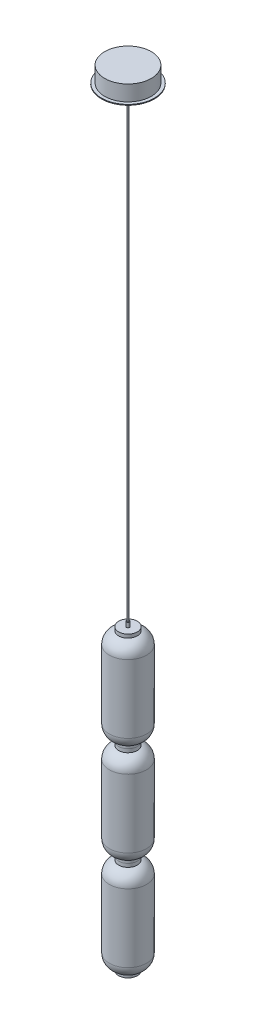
ISO-10303-21;
HEADER;
FILE_DESCRIPTION(('STEP AP214'),'2;1');
FILE_NAME('part.step','',(''),(''),'','','');
FILE_SCHEMA(('AUTOMOTIVE_DESIGN { 1 0 10303 214 1 1 1 1 }'));
ENDSEC;
DATA;
#1=APPLICATION_CONTEXT('core data for automotive mechanical design processes');
#2=APPLICATION_PROTOCOL_DEFINITION('international standard','automotive_design',2000,#1);
#3=PRODUCT_CONTEXT('',#1,'mechanical');
#4=PRODUCT('Part','Part','',(#3));
#5=PRODUCT_RELATED_PRODUCT_CATEGORY('part','',(#4));
#6=PRODUCT_DEFINITION_FORMATION('','',#4);
#7=PRODUCT_DEFINITION_CONTEXT('part definition',#1,'design');
#8=PRODUCT_DEFINITION('design','',#6,#7);
#9=PRODUCT_DEFINITION_SHAPE('','',#8);
#10=(LENGTH_UNIT() NAMED_UNIT(*) SI_UNIT(.MILLI.,.METRE.));
#11=(NAMED_UNIT(*) PLANE_ANGLE_UNIT() SI_UNIT($,.RADIAN.));
#12=(NAMED_UNIT(*) SI_UNIT($,.STERADIAN.) SOLID_ANGLE_UNIT());
#13=UNCERTAINTY_MEASURE_WITH_UNIT(LENGTH_MEASURE(1.E-05),#10,'distance_accuracy_value','');
#14=(GEOMETRIC_REPRESENTATION_CONTEXT(3) GLOBAL_UNCERTAINTY_ASSIGNED_CONTEXT((#13)) GLOBAL_UNIT_ASSIGNED_CONTEXT((#10,
#11,#12)) REPRESENTATION_CONTEXT('',''));
#15=CARTESIAN_POINT('',(0.,0.,0.));
#16=DIRECTION('',(0.,0.,1.));
#17=DIRECTION('',(1.,0.,0.));
#18=AXIS2_PLACEMENT_3D('',#15,#16,#17);
#19=CARTESIAN_POINT('',(0.,2465.,0.));
#20=DIRECTION('',(0.,-1.,0.));
#21=DIRECTION('',(0.,0.,-1.));
#22=AXIS2_PLACEMENT_3D('',#19,#20,#21);
#23=CYLINDRICAL_SURFACE('',#22,2.5);
#24=CARTESIAN_POINT('',(0.,2465.,0.));
#25=DIRECTION('',(0.,1.,0.));
#26=DIRECTION('',(0.,0.,1.));
#27=AXIS2_PLACEMENT_3D('',#24,#25,#26);
#28=CIRCLE('',#27,2.5);
#29=CARTESIAN_POINT('',(0.,2465.,2.5));
#30=VERTEX_POINT('',#29);
#31=EDGE_CURVE('E52',#30,#30,#28,.T.);
#32=ORIENTED_EDGE('',*,*,#31,.F.);
#33=EDGE_LOOP('',(#32));
#34=FACE_BOUND('',#33,.T.);
#35=CARTESIAN_POINT('',(0.,965.,0.));
#36=DIRECTION('',(0.,1.,0.));
#37=DIRECTION('',(0.,0.,1.));
#38=AXIS2_PLACEMENT_3D('',#35,#36,#37);
#39=CIRCLE('',#38,2.5);
#40=CARTESIAN_POINT('',(0.,965.,2.5));
#41=VERTEX_POINT('',#40);
#42=EDGE_CURVE('E48',#41,#41,#39,.T.);
#43=ORIENTED_EDGE('',*,*,#42,.T.);
#44=EDGE_LOOP('',(#43));
#45=FACE_BOUND('',#44,.T.);
#46=ADVANCED_FACE('F45',(#34,#45),#23,.T.);
#47=CARTESIAN_POINT('',(0.,965.,0.));
#48=DIRECTION('',(0.,1.,0.));
#49=DIRECTION('',(0.,0.,1.));
#50=AXIS2_PLACEMENT_3D('',#47,#48,#49);
#51=PLANE('',#50);
#52=ORIENTED_EDGE('',*,*,#42,.F.);
#53=EDGE_LOOP('',(#52));
#54=FACE_BOUND('',#53,.T.);
#55=ADVANCED_FACE('F86',(#54),#51,.F.);
#56=CARTESIAN_POINT('',(0.,2467.54,0.));
#57=DIRECTION('',(0.,-1.,0.));
#58=DIRECTION('',(0.,0.,-1.));
#59=AXIS2_PLACEMENT_3D('',#56,#57,#58);
#60=CYLINDRICAL_SURFACE('',#59,84.963);
#61=CARTESIAN_POINT('',(0.,2467.54,0.));
#62=DIRECTION('',(0.,1.,0.));
#63=DIRECTION('',(0.,0.,1.));
#64=AXIS2_PLACEMENT_3D('',#61,#62,#63);
#65=CIRCLE('',#64,84.963);
#66=CARTESIAN_POINT('',(0.,2467.54,84.963));
#67=VERTEX_POINT('',#66);
#68=EDGE_CURVE('E60',#67,#67,#65,.T.);
#69=ORIENTED_EDGE('',*,*,#68,.F.);
#70=EDGE_LOOP('',(#69));
#71=FACE_BOUND('',#70,.T.);
#72=CARTESIAN_POINT('',(0.,2465.,0.));
#73=DIRECTION('',(0.,1.,0.));
#74=DIRECTION('',(0.,0.,1.));
#75=AXIS2_PLACEMENT_3D('',#72,#73,#74);
#76=CIRCLE('',#75,84.963);
#77=CARTESIAN_POINT('',(0.,2465.,84.963));
#78=VERTEX_POINT('',#77);
#79=EDGE_CURVE('E63',#78,#78,#76,.T.);
#80=ORIENTED_EDGE('',*,*,#79,.T.);
#81=EDGE_LOOP('',(#80));
#82=FACE_BOUND('',#81,.T.);
#83=ADVANCED_FACE('F91',(#71,#82),#60,.T.);
#84=CARTESIAN_POINT('',(0.,2467.54,0.));
#85=DIRECTION('',(0.,1.,0.));
#86=DIRECTION('',(0.,0.,1.));
#87=AXIS2_PLACEMENT_3D('',#84,#85,#86);
#88=PLANE('',#87);
#89=CARTESIAN_POINT('',(0.,2467.54,0.));
#90=DIRECTION('',(0.,1.,0.));
#91=DIRECTION('',(0.,0.,1.));
#92=AXIS2_PLACEMENT_3D('',#89,#90,#91);
#93=CIRCLE('',#92,75.057);
#94=CARTESIAN_POINT('',(0.,2467.54,75.057));
#95=VERTEX_POINT('',#94);
#96=EDGE_CURVE('E11',#95,#95,#93,.T.);
#97=ORIENTED_EDGE('',*,*,#96,.F.);
#98=EDGE_LOOP('',(#97));
#99=FACE_BOUND('',#98,.T.);
#100=ORIENTED_EDGE('',*,*,#68,.T.);
#101=EDGE_LOOP('',(#100));
#102=FACE_BOUND('',#101,.T.);
#103=ADVANCED_FACE('F81',(#99,#102),#88,.T.);
#104=CARTESIAN_POINT('',(0.,2465.,0.));
#105=DIRECTION('',(0.,1.,0.));
#106=DIRECTION('',(0.,0.,1.));
#107=AXIS2_PLACEMENT_3D('',#104,#105,#106);
#108=PLANE('',#107);
#109=ORIENTED_EDGE('',*,*,#31,.T.);
#110=EDGE_LOOP('',(#109));
#111=FACE_BOUND('',#110,.T.);
#112=ORIENTED_EDGE('',*,*,#79,.F.);
#113=EDGE_LOOP('',(#112));
#114=FACE_BOUND('',#113,.T.);
#115=ADVANCED_FACE('F74',(#111,#114),#108,.F.);
#116=CARTESIAN_POINT('',(0.,2517.578,0.));
#117=DIRECTION('',(0.,-1.,0.));
#118=DIRECTION('',(0.,0.,-1.));
#119=AXIS2_PLACEMENT_3D('',#116,#117,#118);
#120=CYLINDRICAL_SURFACE('',#119,75.057);
#121=CARTESIAN_POINT('',(0.,2517.578,0.));
#122=DIRECTION('',(0.,1.,0.));
#123=DIRECTION('',(0.,0.,1.));
#124=AXIS2_PLACEMENT_3D('',#121,#122,#123);
#125=CIRCLE('',#124,75.057);
#126=CARTESIAN_POINT('',(0.,2517.578,75.057));
#127=VERTEX_POINT('',#126);
#128=EDGE_CURVE('E59',#127,#127,#125,.T.);
#129=ORIENTED_EDGE('',*,*,#128,.F.);
#130=EDGE_LOOP('',(#129));
#131=FACE_BOUND('',#130,.T.);
#132=ORIENTED_EDGE('',*,*,#96,.T.);
#133=EDGE_LOOP('',(#132));
#134=FACE_BOUND('',#133,.T.);
#135=ADVANCED_FACE('F72',(#131,#134),#120,.T.);
#136=CARTESIAN_POINT('',(0.,2517.578,0.));
#137=DIRECTION('',(0.,1.,0.));
#138=DIRECTION('',(0.,0.,1.));
#139=AXIS2_PLACEMENT_3D('',#136,#137,#138);
#140=PLANE('',#139);
#141=ORIENTED_EDGE('',*,*,#128,.T.);
#142=EDGE_LOOP('',(#141));
#143=FACE_BOUND('',#142,.T.);
#144=ADVANCED_FACE('F70',(#143),#140,.T.);
#145=CLOSED_SHELL('',(#46,#55,#83,#103,#115,#135,#144));
#146=MANIFOLD_SOLID_BREP('B2',#145);
#147=CARTESIAN_POINT('',(0.,630.,0.));
#148=DIRECTION('',(0.,1.,0.));
#149=DIRECTION('',(0.,0.,-1.));
#150=AXIS2_PLACEMENT_3D('',#147,#148,#149);
#151=CYLINDRICAL_SURFACE('',#150,30.);
#152=CARTESIAN_POINT('',(0.,630.,0.));
#153=DIRECTION('',(0.,1.,0.));
#154=DIRECTION('',(0.,0.,1.));
#155=AXIS2_PLACEMENT_3D('',#152,#153,#154);
#156=CIRCLE('',#155,30.);
#157=CARTESIAN_POINT('',(0.,630.,30.));
#158=VERTEX_POINT('',#157);
#159=EDGE_CURVE('E169',#158,#158,#156,.T.);
#160=ORIENTED_EDGE('',*,*,#159,.T.);
#161=EDGE_LOOP('',(#160));
#162=FACE_BOUND('',#161,.T.);
#163=CARTESIAN_POINT('',(0.,641.270166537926,0.));
#164=DIRECTION('',(0.,-1.,0.));
#165=DIRECTION('',(0.,0.,-1.));
#166=AXIS2_PLACEMENT_3D('',#163,#164,#165);
#167=CIRCLE('',#166,30.);
#168=CARTESIAN_POINT('',(0.,641.270166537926,-30.));
#169=VERTEX_POINT('',#168);
#170=EDGE_CURVE('E173',#169,#169,#167,.F.);
#171=ORIENTED_EDGE('',*,*,#170,.F.);
#172=EDGE_LOOP('',(#171));
#173=FACE_BOUND('',#172,.T.);
#174=ADVANCED_FACE('F163',(#162,#173),#151,.T.);
#175=CARTESIAN_POINT('',(0.,630.,0.));
#176=DIRECTION('',(0.,-1.,0.));
#177=DIRECTION('',(0.,0.,1.));
#178=AXIS2_PLACEMENT_3D('',#175,#176,#177);
#179=PLANE('',#178);
#180=ORIENTED_EDGE('',*,*,#159,.F.);
#181=EDGE_LOOP('',(#180));
#182=FACE_BOUND('',#181,.T.);
#183=ADVANCED_FACE('F184',(#182),#179,.T.);
#184=CARTESIAN_POINT('',(0.,680.,0.));
#185=DIRECTION('',(0.,1.,0.));
#186=DIRECTION('',(0.,0.,-1.));
#187=AXIS2_PLACEMENT_3D('',#184,#185,#186);
#188=DEGENERATE_TOROIDAL_SURFACE('',#187,20.,40.,.T.);
#189=ORIENTED_EDGE('',*,*,#170,.T.);
#190=EDGE_LOOP('',(#189));
#191=FACE_BOUND('',#190,.T.);
#192=CARTESIAN_POINT('',(0.,640.,0.));
#193=DIRECTION('',(0.,-1.,0.));
#194=DIRECTION('',(0.,0.,-1.));
#195=AXIS2_PLACEMENT_3D('',#192,#193,#194);
#196=CIRCLE('',#195,20.);
#197=CARTESIAN_POINT('',(0.,640.,-20.));
#198=VERTEX_POINT('',#197);
#199=EDGE_CURVE('E44',#198,#198,#196,.F.);
#200=ORIENTED_EDGE('',*,*,#199,.F.);
#201=EDGE_LOOP('',(#200));
#202=FACE_BOUND('',#201,.T.);
#203=ADVANCED_FACE('F180',(#191,#202),#188,.F.);
#204=CARTESIAN_POINT('',(0.,640.,0.));
#205=DIRECTION('',(0.,-1.,0.));
#206=DIRECTION('',(0.,0.,1.));
#207=AXIS2_PLACEMENT_3D('',#204,#205,#206);
#208=PLANE('',#207);
#209=ORIENTED_EDGE('',*,*,#199,.T.);
#210=EDGE_LOOP('',(#209));
#211=FACE_BOUND('',#210,.T.);
#212=ADVANCED_FACE('F193',(#211),#208,.F.);
#213=CLOSED_SHELL('',(#174,#183,#203,#212));
#214=MANIFOLD_SOLID_BREP('B6',#213);
#215=CARTESIAN_POINT('',(0.,310.,0.));
#216=DIRECTION('',(0.,1.,0.));
#217=DIRECTION('',(0.,0.,-1.));
#218=AXIS2_PLACEMENT_3D('',#215,#216,#217);
#219=CYLINDRICAL_SURFACE('',#218,30.);
#220=CARTESIAN_POINT('',(0.,310.,0.));
#221=DIRECTION('',(0.,1.,0.));
#222=DIRECTION('',(0.,0.,1.));
#223=AXIS2_PLACEMENT_3D('',#220,#221,#222);
#224=CIRCLE('',#223,30.);
#225=CARTESIAN_POINT('',(0.,310.,30.));
#226=VERTEX_POINT('',#225);
#227=EDGE_CURVE('E232',#226,#226,#224,.T.);
#228=ORIENTED_EDGE('',*,*,#227,.T.);
#229=EDGE_LOOP('',(#228));
#230=FACE_BOUND('',#229,.T.);
#231=CARTESIAN_POINT('',(0.,321.270166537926,0.));
#232=DIRECTION('',(0.,-1.,0.));
#233=DIRECTION('',(0.,0.,-1.));
#234=AXIS2_PLACEMENT_3D('',#231,#232,#233);
#235=CIRCLE('',#234,30.);
#236=CARTESIAN_POINT('',(0.,321.270166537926,-30.));
#237=VERTEX_POINT('',#236);
#238=EDGE_CURVE('E236',#237,#237,#235,.F.);
#239=ORIENTED_EDGE('',*,*,#238,.F.);
#240=EDGE_LOOP('',(#239));
#241=FACE_BOUND('',#240,.T.);
#242=ADVANCED_FACE('F226',(#230,#241),#219,.T.);
#243=CARTESIAN_POINT('',(0.,310.,0.));
#244=DIRECTION('',(0.,-1.,0.));
#245=DIRECTION('',(0.,0.,1.));
#246=AXIS2_PLACEMENT_3D('',#243,#244,#245);
#247=PLANE('',#246);
#248=ORIENTED_EDGE('',*,*,#227,.F.);
#249=EDGE_LOOP('',(#248));
#250=FACE_BOUND('',#249,.T.);
#251=ADVANCED_FACE('F247',(#250),#247,.T.);
#252=CARTESIAN_POINT('',(0.,360.,0.));
#253=DIRECTION('',(0.,1.,0.));
#254=DIRECTION('',(0.,0.,-1.));
#255=AXIS2_PLACEMENT_3D('',#252,#253,#254);
#256=DEGENERATE_TOROIDAL_SURFACE('',#255,20.,40.,.T.);
#257=ORIENTED_EDGE('',*,*,#238,.T.);
#258=EDGE_LOOP('',(#257));
#259=FACE_BOUND('',#258,.T.);
#260=CARTESIAN_POINT('',(0.,320.,0.));
#261=DIRECTION('',(0.,-1.,0.));
#262=DIRECTION('',(0.,0.,-1.));
#263=AXIS2_PLACEMENT_3D('',#260,#261,#262);
#264=CIRCLE('',#263,20.);
#265=CARTESIAN_POINT('',(0.,320.,-20.));
#266=VERTEX_POINT('',#265);
#267=EDGE_CURVE('E162',#266,#266,#264,.F.);
#268=ORIENTED_EDGE('',*,*,#267,.F.);
#269=EDGE_LOOP('',(#268));
#270=FACE_BOUND('',#269,.T.);
#271=ADVANCED_FACE('F243',(#259,#270),#256,.F.);
#272=CARTESIAN_POINT('',(0.,320.,0.));
#273=DIRECTION('',(0.,-1.,0.));
#274=DIRECTION('',(0.,0.,1.));
#275=AXIS2_PLACEMENT_3D('',#272,#273,#274);
#276=PLANE('',#275);
#277=ORIENTED_EDGE('',*,*,#267,.T.);
#278=EDGE_LOOP('',(#277));
#279=FACE_BOUND('',#278,.T.);
#280=ADVANCED_FACE('F256',(#279),#276,.F.);
#281=CLOSED_SHELL('',(#242,#251,#271,#280));
#282=MANIFOLD_SOLID_BREP('B39',#281);
#283=CARTESIAN_POINT('',(-20.,940.,0.));
#284=DIRECTION('',(0.,-1.,0.));
#285=DIRECTION('',(0.,0.,-1.));
#286=AXIS2_PLACEMENT_3D('',#283,#284,#285);
#287=PLANE('',#286);
#288=CARTESIAN_POINT('',(0.,940.,0.));
#289=DIRECTION('',(0.,-1.,0.));
#290=DIRECTION('',(0.,0.,-1.));
#291=AXIS2_PLACEMENT_3D('',#288,#289,#290);
#292=CIRCLE('',#291,20.);
#293=CARTESIAN_POINT('',(0.,940.,-20.));
#294=VERTEX_POINT('',#293);
#295=EDGE_CURVE('E225',#294,#294,#292,.T.);
#296=ORIENTED_EDGE('',*,*,#295,.F.);
#297=EDGE_LOOP('',(#296));
#298=FACE_BOUND('',#297,.T.);
#299=ADVANCED_FACE('F289',(#298),#287,.F.);
#300=CARTESIAN_POINT('',(0.,900.,0.));
#301=DIRECTION('',(0.,-1.,0.));
#302=DIRECTION('',(0.,0.,-1.));
#303=AXIS2_PLACEMENT_3D('',#300,#301,#302);
#304=DEGENERATE_TOROIDAL_SURFACE('',#303,20.,40.,.T.);
#305=CARTESIAN_POINT('',(0.,900.,0.));
#306=DIRECTION('',(0.,-1.,0.));
#307=DIRECTION('',(0.,0.,-1.));
#308=AXIS2_PLACEMENT_3D('',#305,#306,#307);
#309=CIRCLE('',#308,60.);
#310=CARTESIAN_POINT('',(0.,900.,-60.));
#311=VERTEX_POINT('',#310);
#312=EDGE_CURVE('E295',#311,#311,#309,.T.);
#313=ORIENTED_EDGE('',*,*,#312,.F.);
#314=EDGE_LOOP('',(#313));
#315=FACE_BOUND('',#314,.T.);
#316=ORIENTED_EDGE('',*,*,#295,.T.);
#317=EDGE_LOOP('',(#316));
#318=FACE_BOUND('',#317,.T.);
#319=ADVANCED_FACE('F332',(#315,#318),#304,.T.);
#320=CARTESIAN_POINT('',(0.,640.,0.));
#321=DIRECTION('',(0.,-1.,0.));
#322=DIRECTION('',(0.,0.,-1.));
#323=AXIS2_PLACEMENT_3D('',#320,#321,#322);
#324=CYLINDRICAL_SURFACE('',#323,60.);
#325=CARTESIAN_POINT('',(0.,680.,0.));
#326=DIRECTION('',(0.,-1.,0.));
#327=DIRECTION('',(0.,0.,-1.));
#328=AXIS2_PLACEMENT_3D('',#325,#326,#327);
#329=CIRCLE('',#328,60.);
#330=CARTESIAN_POINT('',(0.,680.,-60.));
#331=VERTEX_POINT('',#330);
#332=EDGE_CURVE('E299',#331,#331,#329,.T.);
#333=ORIENTED_EDGE('',*,*,#332,.F.);
#334=EDGE_LOOP('',(#333));
#335=FACE_BOUND('',#334,.T.);
#336=ORIENTED_EDGE('',*,*,#312,.T.);
#337=EDGE_LOOP('',(#336));
#338=FACE_BOUND('',#337,.T.);
#339=ADVANCED_FACE('F327',(#335,#338),#324,.T.);
#340=CARTESIAN_POINT('',(0.,680.,0.));
#341=DIRECTION('',(0.,-1.,0.));
#342=DIRECTION('',(0.,0.,-1.));
#343=AXIS2_PLACEMENT_3D('',#340,#341,#342);
#344=DEGENERATE_TOROIDAL_SURFACE('',#343,20.,40.,.T.);
#345=CARTESIAN_POINT('',(0.,640.,0.));
#346=DIRECTION('',(0.,-1.,0.));
#347=DIRECTION('',(0.,0.,-1.));
#348=AXIS2_PLACEMENT_3D('',#345,#346,#347);
#349=CIRCLE('',#348,20.);
#350=CARTESIAN_POINT('',(0.,640.,-20.));
#351=VERTEX_POINT('',#350);
#352=EDGE_CURVE('E313',#351,#351,#349,.T.);
#353=ORIENTED_EDGE('',*,*,#352,.F.);
#354=EDGE_LOOP('',(#353));
#355=FACE_BOUND('',#354,.T.);
#356=ORIENTED_EDGE('',*,*,#332,.T.);
#357=EDGE_LOOP('',(#356));
#358=FACE_BOUND('',#357,.T.);
#359=ADVANCED_FACE('F324',(#355,#358),#344,.T.);
#360=CARTESIAN_POINT('',(0.,640.,0.));
#361=DIRECTION('',(0.,1.,0.));
#362=DIRECTION('',(0.,0.,1.));
#363=AXIS2_PLACEMENT_3D('',#360,#361,#362);
#364=CYLINDRICAL_SURFACE('',#363,20.);
#365=ORIENTED_EDGE('',*,*,#352,.T.);
#366=EDGE_LOOP('',(#365));
#367=FACE_BOUND('',#366,.T.);
#368=CARTESIAN_POINT('',(0.,648.,0.));
#369=DIRECTION('',(0.,1.,0.));
#370=DIRECTION('',(0.,0.,1.));
#371=AXIS2_PLACEMENT_3D('',#368,#369,#370);
#372=CIRCLE('',#371,20.);
#373=CARTESIAN_POINT('',(0.,648.,20.));
#374=VERTEX_POINT('',#373);
#375=EDGE_CURVE('E303',#374,#374,#372,.F.);
#376=ORIENTED_EDGE('',*,*,#375,.F.);
#377=EDGE_LOOP('',(#376));
#378=FACE_BOUND('',#377,.T.);
#379=ADVANCED_FACE('F321',(#367,#378),#364,.F.);
#380=CARTESIAN_POINT('',(-20.,932.,0.));
#381=DIRECTION('',(0.,-1.,0.));
#382=DIRECTION('',(0.,0.,-1.));
#383=AXIS2_PLACEMENT_3D('',#380,#381,#382);
#384=PLANE('',#383);
#385=CARTESIAN_POINT('',(0.,932.,0.));
#386=DIRECTION('',(0.,-1.,0.));
#387=DIRECTION('',(0.,0.,-1.));
#388=AXIS2_PLACEMENT_3D('',#385,#386,#387);
#389=CIRCLE('',#388,20.);
#390=CARTESIAN_POINT('',(0.,932.,-20.));
#391=VERTEX_POINT('',#390);
#392=EDGE_CURVE('E308',#391,#391,#389,.T.);
#393=ORIENTED_EDGE('',*,*,#392,.T.);
#394=EDGE_LOOP('',(#393));
#395=FACE_BOUND('',#394,.T.);
#396=ADVANCED_FACE('F365',(#395),#384,.T.);
#397=CARTESIAN_POINT('',(0.,900.,0.));
#398=DIRECTION('',(0.,-1.,0.));
#399=DIRECTION('',(0.,0.,-1.));
#400=AXIS2_PLACEMENT_3D('',#397,#398,#399);
#401=DEGENERATE_TOROIDAL_SURFACE('',#400,20.,32.,.T.);
#402=CARTESIAN_POINT('',(0.,900.,0.));
#403=DIRECTION('',(0.,-1.,0.));
#404=DIRECTION('',(0.,0.,-1.));
#405=AXIS2_PLACEMENT_3D('',#402,#403,#404);
#406=CIRCLE('',#405,52.);
#407=CARTESIAN_POINT('',(0.,900.,-52.));
#408=VERTEX_POINT('',#407);
#409=EDGE_CURVE('E312',#408,#408,#406,.T.);
#410=ORIENTED_EDGE('',*,*,#409,.T.);
#411=EDGE_LOOP('',(#410));
#412=FACE_BOUND('',#411,.T.);
#413=ORIENTED_EDGE('',*,*,#392,.F.);
#414=EDGE_LOOP('',(#413));
#415=FACE_BOUND('',#414,.T.);
#416=ADVANCED_FACE('F374',(#412,#415),#401,.F.);
#417=CARTESIAN_POINT('',(0.,640.,0.));
#418=DIRECTION('',(0.,-1.,0.));
#419=DIRECTION('',(0.,0.,-1.));
#420=AXIS2_PLACEMENT_3D('',#417,#418,#419);
#421=CYLINDRICAL_SURFACE('',#420,52.);
#422=CARTESIAN_POINT('',(0.,680.,0.));
#423=DIRECTION('',(0.,-1.,0.));
#424=DIRECTION('',(0.,0.,-1.));
#425=AXIS2_PLACEMENT_3D('',#422,#423,#424);
#426=CIRCLE('',#425,52.);
#427=CARTESIAN_POINT('',(0.,680.,-52.));
#428=VERTEX_POINT('',#427);
#429=EDGE_CURVE('E309',#428,#428,#426,.T.);
#430=ORIENTED_EDGE('',*,*,#429,.T.);
#431=EDGE_LOOP('',(#430));
#432=FACE_BOUND('',#431,.T.);
#433=ORIENTED_EDGE('',*,*,#409,.F.);
#434=EDGE_LOOP('',(#433));
#435=FACE_BOUND('',#434,.T.);
#436=ADVANCED_FACE('F384',(#432,#435),#421,.F.);
#437=CARTESIAN_POINT('',(0.,680.,0.));
#438=DIRECTION('',(0.,-1.,0.));
#439=DIRECTION('',(0.,0.,-1.));
#440=AXIS2_PLACEMENT_3D('',#437,#438,#439);
#441=DEGENERATE_TOROIDAL_SURFACE('',#440,20.,32.,.T.);
#442=ORIENTED_EDGE('',*,*,#375,.T.);
#443=EDGE_LOOP('',(#442));
#444=FACE_BOUND('',#443,.T.);
#445=ORIENTED_EDGE('',*,*,#429,.F.);
#446=EDGE_LOOP('',(#445));
#447=FACE_BOUND('',#446,.T.);
#448=ADVANCED_FACE('F394',(#444,#447),#441,.F.);
#449=CLOSED_SHELL('',(#299,#319,#339,#359,#379,#396,#416,#436,#448));
#450=MANIFOLD_SOLID_BREP('B157',#449);
#451=CARTESIAN_POINT('',(-20.,620.,0.));
#452=DIRECTION('',(0.,-1.,0.));
#453=DIRECTION('',(0.,0.,-1.));
#454=AXIS2_PLACEMENT_3D('',#451,#452,#453);
#455=PLANE('',#454);
#456=CARTESIAN_POINT('',(0.,620.,0.));
#457=DIRECTION('',(0.,-1.,0.));
#458=DIRECTION('',(0.,0.,-1.));
#459=AXIS2_PLACEMENT_3D('',#456,#457,#458);
#460=CIRCLE('',#459,20.);
#461=CARTESIAN_POINT('',(0.,620.,-20.));
#462=VERTEX_POINT('',#461);
#463=EDGE_CURVE('E288',#462,#462,#460,.T.);
#464=ORIENTED_EDGE('',*,*,#463,.F.);
#465=EDGE_LOOP('',(#464));
#466=FACE_BOUND('',#465,.T.);
#467=ADVANCED_FACE('F427',(#466),#455,.F.);
#468=CARTESIAN_POINT('',(0.,580.,0.));
#469=DIRECTION('',(0.,-1.,0.));
#470=DIRECTION('',(0.,0.,-1.));
#471=AXIS2_PLACEMENT_3D('',#468,#469,#470);
#472=DEGENERATE_TOROIDAL_SURFACE('',#471,20.,40.,.T.);
#473=CARTESIAN_POINT('',(0.,580.,0.));
#474=DIRECTION('',(0.,-1.,0.));
#475=DIRECTION('',(0.,0.,-1.));
#476=AXIS2_PLACEMENT_3D('',#473,#474,#475);
#477=CIRCLE('',#476,60.);
#478=CARTESIAN_POINT('',(0.,580.,-60.));
#479=VERTEX_POINT('',#478);
#480=EDGE_CURVE('E433',#479,#479,#477,.T.);
#481=ORIENTED_EDGE('',*,*,#480,.F.);
#482=EDGE_LOOP('',(#481));
#483=FACE_BOUND('',#482,.T.);
#484=ORIENTED_EDGE('',*,*,#463,.T.);
#485=EDGE_LOOP('',(#484));
#486=FACE_BOUND('',#485,.T.);
#487=ADVANCED_FACE('F470',(#483,#486),#472,.T.);
#488=CARTESIAN_POINT('',(0.,320.,0.));
#489=DIRECTION('',(0.,-1.,0.));
#490=DIRECTION('',(0.,0.,-1.));
#491=AXIS2_PLACEMENT_3D('',#488,#489,#490);
#492=CYLINDRICAL_SURFACE('',#491,60.);
#493=CARTESIAN_POINT('',(0.,360.,0.));
#494=DIRECTION('',(0.,-1.,0.));
#495=DIRECTION('',(0.,0.,-1.));
#496=AXIS2_PLACEMENT_3D('',#493,#494,#495);
#497=CIRCLE('',#496,60.);
#498=CARTESIAN_POINT('',(0.,360.,-60.));
#499=VERTEX_POINT('',#498);
#500=EDGE_CURVE('E437',#499,#499,#497,.T.);
#501=ORIENTED_EDGE('',*,*,#500,.F.);
#502=EDGE_LOOP('',(#501));
#503=FACE_BOUND('',#502,.T.);
#504=ORIENTED_EDGE('',*,*,#480,.T.);
#505=EDGE_LOOP('',(#504));
#506=FACE_BOUND('',#505,.T.);
#507=ADVANCED_FACE('F465',(#503,#506),#492,.T.);
#508=CARTESIAN_POINT('',(0.,360.,0.));
#509=DIRECTION('',(0.,-1.,0.));
#510=DIRECTION('',(0.,0.,-1.));
#511=AXIS2_PLACEMENT_3D('',#508,#509,#510);
#512=DEGENERATE_TOROIDAL_SURFACE('',#511,20.,40.,.T.);
#513=CARTESIAN_POINT('',(0.,320.,0.));
#514=DIRECTION('',(0.,-1.,0.));
#515=DIRECTION('',(0.,0.,-1.));
#516=AXIS2_PLACEMENT_3D('',#513,#514,#515);
#517=CIRCLE('',#516,20.);
#518=CARTESIAN_POINT('',(0.,320.,-20.));
#519=VERTEX_POINT('',#518);
#520=EDGE_CURVE('E451',#519,#519,#517,.T.);
#521=ORIENTED_EDGE('',*,*,#520,.F.);
#522=EDGE_LOOP('',(#521));
#523=FACE_BOUND('',#522,.T.);
#524=ORIENTED_EDGE('',*,*,#500,.T.);
#525=EDGE_LOOP('',(#524));
#526=FACE_BOUND('',#525,.T.);
#527=ADVANCED_FACE('F462',(#523,#526),#512,.T.);
#528=CARTESIAN_POINT('',(0.,320.,0.));
#529=DIRECTION('',(0.,1.,0.));
#530=DIRECTION('',(0.,0.,1.));
#531=AXIS2_PLACEMENT_3D('',#528,#529,#530);
#532=CYLINDRICAL_SURFACE('',#531,20.);
#533=ORIENTED_EDGE('',*,*,#520,.T.);
#534=EDGE_LOOP('',(#533));
#535=FACE_BOUND('',#534,.T.);
#536=CARTESIAN_POINT('',(0.,328.,0.));
#537=DIRECTION('',(0.,1.,0.));
#538=DIRECTION('',(0.,0.,1.));
#539=AXIS2_PLACEMENT_3D('',#536,#537,#538);
#540=CIRCLE('',#539,20.);
#541=CARTESIAN_POINT('',(0.,328.,20.));
#542=VERTEX_POINT('',#541);
#543=EDGE_CURVE('E441',#542,#542,#540,.F.);
#544=ORIENTED_EDGE('',*,*,#543,.F.);
#545=EDGE_LOOP('',(#544));
#546=FACE_BOUND('',#545,.T.);
#547=ADVANCED_FACE('F459',(#535,#546),#532,.F.);
#548=CARTESIAN_POINT('',(-20.,612.,0.));
#549=DIRECTION('',(0.,-1.,0.));
#550=DIRECTION('',(0.,0.,-1.));
#551=AXIS2_PLACEMENT_3D('',#548,#549,#550);
#552=PLANE('',#551);
#553=CARTESIAN_POINT('',(0.,612.,0.));
#554=DIRECTION('',(0.,-1.,0.));
#555=DIRECTION('',(0.,0.,-1.));
#556=AXIS2_PLACEMENT_3D('',#553,#554,#555);
#557=CIRCLE('',#556,20.);
#558=CARTESIAN_POINT('',(0.,612.,-20.));
#559=VERTEX_POINT('',#558);
#560=EDGE_CURVE('E446',#559,#559,#557,.T.);
#561=ORIENTED_EDGE('',*,*,#560,.T.);
#562=EDGE_LOOP('',(#561));
#563=FACE_BOUND('',#562,.T.);
#564=ADVANCED_FACE('F503',(#563),#552,.T.);
#565=CARTESIAN_POINT('',(0.,580.,0.));
#566=DIRECTION('',(0.,-1.,0.));
#567=DIRECTION('',(0.,0.,-1.));
#568=AXIS2_PLACEMENT_3D('',#565,#566,#567);
#569=DEGENERATE_TOROIDAL_SURFACE('',#568,20.,32.,.T.);
#570=CARTESIAN_POINT('',(0.,580.,0.));
#571=DIRECTION('',(0.,-1.,0.));
#572=DIRECTION('',(0.,0.,-1.));
#573=AXIS2_PLACEMENT_3D('',#570,#571,#572);
#574=CIRCLE('',#573,52.);
#575=CARTESIAN_POINT('',(0.,580.,-52.));
#576=VERTEX_POINT('',#575);
#577=EDGE_CURVE('E450',#576,#576,#574,.T.);
#578=ORIENTED_EDGE('',*,*,#577,.T.);
#579=EDGE_LOOP('',(#578));
#580=FACE_BOUND('',#579,.T.);
#581=ORIENTED_EDGE('',*,*,#560,.F.);
#582=EDGE_LOOP('',(#581));
#583=FACE_BOUND('',#582,.T.);
#584=ADVANCED_FACE('F512',(#580,#583),#569,.F.);
#585=CARTESIAN_POINT('',(0.,320.,0.));
#586=DIRECTION('',(0.,-1.,0.));
#587=DIRECTION('',(0.,0.,-1.));
#588=AXIS2_PLACEMENT_3D('',#585,#586,#587);
#589=CYLINDRICAL_SURFACE('',#588,52.);
#590=CARTESIAN_POINT('',(0.,360.,0.));
#591=DIRECTION('',(0.,-1.,0.));
#592=DIRECTION('',(0.,0.,-1.));
#593=AXIS2_PLACEMENT_3D('',#590,#591,#592);
#594=CIRCLE('',#593,52.);
#595=CARTESIAN_POINT('',(0.,360.,-52.));
#596=VERTEX_POINT('',#595);
#597=EDGE_CURVE('E447',#596,#596,#594,.T.);
#598=ORIENTED_EDGE('',*,*,#597,.T.);
#599=EDGE_LOOP('',(#598));
#600=FACE_BOUND('',#599,.T.);
#601=ORIENTED_EDGE('',*,*,#577,.F.);
#602=EDGE_LOOP('',(#601));
#603=FACE_BOUND('',#602,.T.);
#604=ADVANCED_FACE('F522',(#600,#603),#589,.F.);
#605=CARTESIAN_POINT('',(0.,360.,0.));
#606=DIRECTION('',(0.,-1.,0.));
#607=DIRECTION('',(0.,0.,-1.));
#608=AXIS2_PLACEMENT_3D('',#605,#606,#607);
#609=DEGENERATE_TOROIDAL_SURFACE('',#608,20.,32.,.T.);
#610=ORIENTED_EDGE('',*,*,#543,.T.);
#611=EDGE_LOOP('',(#610));
#612=FACE_BOUND('',#611,.T.);
#613=ORIENTED_EDGE('',*,*,#597,.F.);
#614=EDGE_LOOP('',(#613));
#615=FACE_BOUND('',#614,.T.);
#616=ADVANCED_FACE('F532',(#612,#615),#609,.F.);
#617=CLOSED_SHELL('',(#467,#487,#507,#527,#547,#564,#584,#604,#616));
#618=MANIFOLD_SOLID_BREP('B220',#617);
#619=CARTESIAN_POINT('',(0.,950.,0.));
#620=DIRECTION('',(0.,-1.,0.));
#621=DIRECTION('',(0.,0.,-1.));
#622=AXIS2_PLACEMENT_3D('',#619,#620,#621);
#623=CYLINDRICAL_SURFACE('',#622,30.);
#624=CARTESIAN_POINT('',(0.,950.,0.));
#625=DIRECTION('',(0.,1.,0.));
#626=DIRECTION('',(0.,0.,1.));
#627=AXIS2_PLACEMENT_3D('',#624,#625,#626);
#628=CIRCLE('',#627,30.);
#629=CARTESIAN_POINT('',(0.,950.,30.));
#630=VERTEX_POINT('',#629);
#631=EDGE_CURVE('E576',#630,#630,#628,.T.);
#632=ORIENTED_EDGE('',*,*,#631,.F.);
#633=EDGE_LOOP('',(#632));
#634=FACE_BOUND('',#633,.T.);
#635=CARTESIAN_POINT('',(0.,938.729833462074,0.));
#636=DIRECTION('',(0.,-1.,0.));
#637=DIRECTION('',(0.,0.,-1.));
#638=AXIS2_PLACEMENT_3D('',#635,#636,#637);
#639=CIRCLE('',#638,30.);
#640=CARTESIAN_POINT('',(0.,938.729833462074,-30.));
#641=VERTEX_POINT('',#640);
#642=EDGE_CURVE('E580',#641,#641,#639,.F.);
#643=ORIENTED_EDGE('',*,*,#642,.T.);
#644=EDGE_LOOP('',(#643));
#645=FACE_BOUND('',#644,.T.);
#646=ADVANCED_FACE('F565',(#634,#645),#623,.T.);
#647=CARTESIAN_POINT('',(0.,950.,0.));
#648=DIRECTION('',(0.,1.,0.));
#649=DIRECTION('',(0.,0.,1.));
#650=AXIS2_PLACEMENT_3D('',#647,#648,#649);
#651=PLANE('',#650);
#652=CARTESIAN_POINT('',(0.,950.,0.));
#653=DIRECTION('',(0.,1.,0.));
#654=DIRECTION('',(0.,0.,1.));
#655=AXIS2_PLACEMENT_3D('',#652,#653,#654);
#656=CIRCLE('',#655,5.);
#657=CARTESIAN_POINT('',(0.,950.,5.));
#658=VERTEX_POINT('',#657);
#659=EDGE_CURVE('E426',#658,#658,#656,.T.);
#660=ORIENTED_EDGE('',*,*,#659,.F.);
#661=EDGE_LOOP('',(#660));
#662=FACE_BOUND('',#661,.T.);
#663=ORIENTED_EDGE('',*,*,#631,.T.);
#664=EDGE_LOOP('',(#663));
#665=FACE_BOUND('',#664,.T.);
#666=ADVANCED_FACE('F585',(#662,#665),#651,.T.);
#667=CARTESIAN_POINT('',(0.,900.,0.));
#668=DIRECTION('',(0.,-1.,0.));
#669=DIRECTION('',(0.,0.,-1.));
#670=AXIS2_PLACEMENT_3D('',#667,#668,#669);
#671=DEGENERATE_TOROIDAL_SURFACE('',#670,20.,40.,.T.);
#672=ORIENTED_EDGE('',*,*,#642,.F.);
#673=EDGE_LOOP('',(#672));
#674=FACE_BOUND('',#673,.T.);
#675=CARTESIAN_POINT('',(0.,940.,0.));
#676=DIRECTION('',(0.,-1.,0.));
#677=DIRECTION('',(0.,0.,-1.));
#678=AXIS2_PLACEMENT_3D('',#675,#676,#677);
#679=CIRCLE('',#678,20.);
#680=CARTESIAN_POINT('',(0.,940.,-20.));
#681=VERTEX_POINT('',#680);
#682=EDGE_CURVE('E568',#681,#681,#679,.F.);
#683=ORIENTED_EDGE('',*,*,#682,.T.);
#684=EDGE_LOOP('',(#683));
#685=FACE_BOUND('',#684,.T.);
#686=ADVANCED_FACE('F591',(#674,#685),#671,.F.);
#687=CARTESIAN_POINT('',(0.,940.,0.));
#688=DIRECTION('',(0.,1.,0.));
#689=DIRECTION('',(0.,0.,1.));
#690=AXIS2_PLACEMENT_3D('',#687,#688,#689);
#691=PLANE('',#690);
#692=ORIENTED_EDGE('',*,*,#682,.F.);
#693=EDGE_LOOP('',(#692));
#694=FACE_BOUND('',#693,.T.);
#695=ADVANCED_FACE('F594',(#694),#691,.F.);
#696=CARTESIAN_POINT('',(0.,965.,0.));
#697=DIRECTION('',(0.,-1.,0.));
#698=DIRECTION('',(0.,0.,-1.));
#699=AXIS2_PLACEMENT_3D('',#696,#697,#698);
#700=CYLINDRICAL_SURFACE('',#699,5.);
#701=CARTESIAN_POINT('',(0.,965.,0.));
#702=DIRECTION('',(0.,1.,0.));
#703=DIRECTION('',(0.,0.,1.));
#704=AXIS2_PLACEMENT_3D('',#701,#702,#703);
#705=CIRCLE('',#704,5.);
#706=CARTESIAN_POINT('',(0.,965.,5.));
#707=VERTEX_POINT('',#706);
#708=EDGE_CURVE('E579',#707,#707,#705,.T.);
#709=ORIENTED_EDGE('',*,*,#708,.F.);
#710=EDGE_LOOP('',(#709));
#711=FACE_BOUND('',#710,.T.);
#712=ORIENTED_EDGE('',*,*,#659,.T.);
#713=EDGE_LOOP('',(#712));
#714=FACE_BOUND('',#713,.T.);
#715=ADVANCED_FACE('F599',(#711,#714),#700,.T.);
#716=CARTESIAN_POINT('',(0.,965.,0.));
#717=DIRECTION('',(0.,1.,0.));
#718=DIRECTION('',(0.,0.,1.));
#719=AXIS2_PLACEMENT_3D('',#716,#717,#718);
#720=PLANE('',#719);
#721=ORIENTED_EDGE('',*,*,#708,.T.);
#722=EDGE_LOOP('',(#721));
#723=FACE_BOUND('',#722,.T.);
#724=ADVANCED_FACE('F603',(#723),#720,.T.);
#725=CLOSED_SHELL('',(#646,#666,#686,#695,#715,#724));
#726=MANIFOLD_SOLID_BREP('B283',#725);
#727=CARTESIAN_POINT('',(0.,630.,0.));
#728=DIRECTION('',(0.,-1.,0.));
#729=DIRECTION('',(0.,0.,-1.));
#730=AXIS2_PLACEMENT_3D('',#727,#728,#729);
#731=CYLINDRICAL_SURFACE('',#730,30.);
#732=CARTESIAN_POINT('',(0.,630.,0.));
#733=DIRECTION('',(0.,1.,0.));
#734=DIRECTION('',(0.,0.,1.));
#735=AXIS2_PLACEMENT_3D('',#732,#733,#734);
#736=CIRCLE('',#735,30.);
#737=CARTESIAN_POINT('',(0.,630.,30.));
#738=VERTEX_POINT('',#737);
#739=EDGE_CURVE('E664',#738,#738,#736,.T.);
#740=ORIENTED_EDGE('',*,*,#739,.F.);
#741=EDGE_LOOP('',(#740));
#742=FACE_BOUND('',#741,.T.);
#743=CARTESIAN_POINT('',(0.,618.729833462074,0.));
#744=DIRECTION('',(0.,-1.,0.));
#745=DIRECTION('',(0.,0.,-1.));
#746=AXIS2_PLACEMENT_3D('',#743,#744,#745);
#747=CIRCLE('',#746,30.);
#748=CARTESIAN_POINT('',(0.,618.729833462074,-30.));
#749=VERTEX_POINT('',#748);
#750=EDGE_CURVE('E668',#749,#749,#747,.F.);
#751=ORIENTED_EDGE('',*,*,#750,.T.);
#752=EDGE_LOOP('',(#751));
#753=FACE_BOUND('',#752,.T.);
#754=ADVANCED_FACE('F658',(#742,#753),#731,.T.);
#755=CARTESIAN_POINT('',(0.,630.,0.));
#756=DIRECTION('',(0.,1.,0.));
#757=DIRECTION('',(0.,0.,1.));
#758=AXIS2_PLACEMENT_3D('',#755,#756,#757);
#759=PLANE('',#758);
#760=ORIENTED_EDGE('',*,*,#739,.T.);
#761=EDGE_LOOP('',(#760));
#762=FACE_BOUND('',#761,.T.);
#763=ADVANCED_FACE('F679',(#762),#759,.T.);
#764=CARTESIAN_POINT('',(0.,580.,0.));
#765=DIRECTION('',(0.,-1.,0.));
#766=DIRECTION('',(0.,0.,-1.));
#767=AXIS2_PLACEMENT_3D('',#764,#765,#766);
#768=DEGENERATE_TOROIDAL_SURFACE('',#767,20.,40.,.T.);
#769=ORIENTED_EDGE('',*,*,#750,.F.);
#770=EDGE_LOOP('',(#769));
#771=FACE_BOUND('',#770,.T.);
#772=CARTESIAN_POINT('',(0.,620.,0.));
#773=DIRECTION('',(0.,-1.,0.));
#774=DIRECTION('',(0.,0.,-1.));
#775=AXIS2_PLACEMENT_3D('',#772,#773,#774);
#776=CIRCLE('',#775,20.);
#777=CARTESIAN_POINT('',(0.,620.,-20.));
#778=VERTEX_POINT('',#777);
#779=EDGE_CURVE('E564',#778,#778,#776,.F.);
#780=ORIENTED_EDGE('',*,*,#779,.T.);
#781=EDGE_LOOP('',(#780));
#782=FACE_BOUND('',#781,.T.);
#783=ADVANCED_FACE('F676',(#771,#782),#768,.F.);
#784=CARTESIAN_POINT('',(0.,620.,0.));
#785=DIRECTION('',(0.,1.,0.));
#786=DIRECTION('',(0.,0.,1.));
#787=AXIS2_PLACEMENT_3D('',#784,#785,#786);
#788=PLANE('',#787);
#789=ORIENTED_EDGE('',*,*,#779,.F.);
#790=EDGE_LOOP('',(#789));
#791=FACE_BOUND('',#790,.T.);
#792=ADVANCED_FACE('F678',(#791),#788,.F.);
#793=CLOSED_SHELL('',(#754,#763,#783,#792));
#794=MANIFOLD_SOLID_BREP('B421',#793);
#795=CARTESIAN_POINT('',(0.,5.,0.));
#796=DIRECTION('',(0.,1.,0.));
#797=DIRECTION('',(0.,0.,1.));
#798=AXIS2_PLACEMENT_3D('',#795,#796,#797);
#799=CYLINDRICAL_SURFACE('',#798,30.);
#800=CARTESIAN_POINT('',(0.,5.,0.));
#801=DIRECTION('',(0.,1.,0.));
#802=DIRECTION('',(0.,0.,1.));
#803=AXIS2_PLACEMENT_3D('',#800,#801,#802);
#804=CIRCLE('',#803,30.);
#805=CARTESIAN_POINT('',(0.,5.,30.));
#806=VERTEX_POINT('',#805);
#807=EDGE_CURVE('E657',#806,#806,#804,.T.);
#808=ORIENTED_EDGE('',*,*,#807,.T.);
#809=EDGE_LOOP('',(#808));
#810=FACE_BOUND('',#809,.T.);
#811=CARTESIAN_POINT('',(0.,295.,0.));
#812=DIRECTION('',(0.,1.,0.));
#813=DIRECTION('',(0.,0.,1.));
#814=AXIS2_PLACEMENT_3D('',#811,#812,#813);
#815=CIRCLE('',#814,30.);
#816=CARTESIAN_POINT('',(0.,295.,30.));
#817=VERTEX_POINT('',#816);
#818=EDGE_CURVE('E727',#817,#817,#815,.T.);
#819=ORIENTED_EDGE('',*,*,#818,.F.);
#820=EDGE_LOOP('',(#819));
#821=FACE_BOUND('',#820,.T.);
#822=ADVANCED_FACE('F721',(#810,#821),#799,.T.);
#823=CARTESIAN_POINT('',(0.,5.,0.));
#824=DIRECTION('',(0.,1.,0.));
#825=DIRECTION('',(0.,0.,1.));
#826=AXIS2_PLACEMENT_3D('',#823,#824,#825);
#827=PLANE('',#826);
#828=ORIENTED_EDGE('',*,*,#807,.F.);
#829=EDGE_LOOP('',(#828));
#830=FACE_BOUND('',#829,.T.);
#831=ADVANCED_FACE('F736',(#830),#827,.F.);
#832=CARTESIAN_POINT('',(0.,295.,0.));
#833=DIRECTION('',(0.,1.,0.));
#834=DIRECTION('',(0.,0.,1.));
#835=AXIS2_PLACEMENT_3D('',#832,#833,#834);
#836=PLANE('',#835);
#837=ORIENTED_EDGE('',*,*,#818,.T.);
#838=EDGE_LOOP('',(#837));
#839=FACE_BOUND('',#838,.T.);
#840=ADVANCED_FACE('F733',(#839),#836,.T.);
#841=CLOSED_SHELL('',(#822,#831,#840));
#842=MANIFOLD_SOLID_BREP('B559',#841);
#843=CARTESIAN_POINT('',(0.,-10.,0.));
#844=DIRECTION('',(0.,1.,0.));
#845=DIRECTION('',(0.,0.,-1.));
#846=AXIS2_PLACEMENT_3D('',#843,#844,#845);
#847=CYLINDRICAL_SURFACE('',#846,30.);
#848=CARTESIAN_POINT('',(0.,-10.,0.));
#849=DIRECTION('',(0.,1.,0.));
#850=DIRECTION('',(0.,0.,1.));
#851=AXIS2_PLACEMENT_3D('',#848,#849,#850);
#852=CIRCLE('',#851,30.);
#853=CARTESIAN_POINT('',(0.,-10.,30.));
#854=VERTEX_POINT('',#853);
#855=EDGE_CURVE('E775',#854,#854,#852,.T.);
#856=ORIENTED_EDGE('',*,*,#855,.T.);
#857=EDGE_LOOP('',(#856));
#858=FACE_BOUND('',#857,.T.);
#859=CARTESIAN_POINT('',(0.,1.27016653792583,0.));
#860=DIRECTION('',(0.,-1.,0.));
#861=DIRECTION('',(0.,0.,-1.));
#862=AXIS2_PLACEMENT_3D('',#859,#860,#861);
#863=CIRCLE('',#862,30.);
#864=CARTESIAN_POINT('',(0.,1.27016653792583,-30.));
#865=VERTEX_POINT('',#864);
#866=EDGE_CURVE('E779',#865,#865,#863,.F.);
#867=ORIENTED_EDGE('',*,*,#866,.F.);
#868=EDGE_LOOP('',(#867));
#869=FACE_BOUND('',#868,.T.);
#870=ADVANCED_FACE('F769',(#858,#869),#847,.T.);
#871=CARTESIAN_POINT('',(0.,-10.,0.));
#872=DIRECTION('',(0.,-1.,0.));
#873=DIRECTION('',(0.,0.,1.));
#874=AXIS2_PLACEMENT_3D('',#871,#872,#873);
#875=PLANE('',#874);
#876=ORIENTED_EDGE('',*,*,#855,.F.);
#877=EDGE_LOOP('',(#876));
#878=FACE_BOUND('',#877,.T.);
#879=ADVANCED_FACE('F790',(#878),#875,.T.);
#880=CARTESIAN_POINT('',(0.,40.,0.));
#881=DIRECTION('',(0.,1.,0.));
#882=DIRECTION('',(0.,0.,-1.));
#883=AXIS2_PLACEMENT_3D('',#880,#881,#882);
#884=DEGENERATE_TOROIDAL_SURFACE('',#883,20.,40.,.T.);
#885=ORIENTED_EDGE('',*,*,#866,.T.);
#886=EDGE_LOOP('',(#885));
#887=FACE_BOUND('',#886,.T.);
#888=CARTESIAN_POINT('',(0.,0.,0.));
#889=DIRECTION('',(0.,-1.,0.));
#890=DIRECTION('',(0.,0.,-1.));
#891=AXIS2_PLACEMENT_3D('',#888,#889,#890);
#892=CIRCLE('',#891,20.);
#893=CARTESIAN_POINT('',(0.,0.,-20.));
#894=VERTEX_POINT('',#893);
#895=EDGE_CURVE('E720',#894,#894,#892,.F.);
#896=ORIENTED_EDGE('',*,*,#895,.F.);
#897=EDGE_LOOP('',(#896));
#898=FACE_BOUND('',#897,.T.);
#899=ADVANCED_FACE('F786',(#887,#898),#884,.F.);
#900=CARTESIAN_POINT('',(0.,0.,0.));
#901=DIRECTION('',(0.,-1.,0.));
#902=DIRECTION('',(0.,0.,1.));
#903=AXIS2_PLACEMENT_3D('',#900,#901,#902);
#904=PLANE('',#903);
#905=ORIENTED_EDGE('',*,*,#895,.T.);
#906=EDGE_LOOP('',(#905));
#907=FACE_BOUND('',#906,.T.);
#908=ADVANCED_FACE('F799',(#907),#904,.F.);
#909=CLOSED_SHELL('',(#870,#879,#899,#908));
#910=MANIFOLD_SOLID_BREP('B652',#909);
#911=CARTESIAN_POINT('',(0.,310.,0.));
#912=DIRECTION('',(0.,-1.,0.));
#913=DIRECTION('',(0.,0.,-1.));
#914=AXIS2_PLACEMENT_3D('',#911,#912,#913);
#915=CYLINDRICAL_SURFACE('',#914,30.);
#916=CARTESIAN_POINT('',(0.,310.,0.));
#917=DIRECTION('',(0.,1.,0.));
#918=DIRECTION('',(0.,0.,1.));
#919=AXIS2_PLACEMENT_3D('',#916,#917,#918);
#920=CIRCLE('',#919,30.);
#921=CARTESIAN_POINT('',(0.,310.,30.));
#922=VERTEX_POINT('',#921);
#923=EDGE_CURVE('E837',#922,#922,#920,.T.);
#924=ORIENTED_EDGE('',*,*,#923,.F.);
#925=EDGE_LOOP('',(#924));
#926=FACE_BOUND('',#925,.T.);
#927=CARTESIAN_POINT('',(0.,298.729833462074,0.));
#928=DIRECTION('',(0.,-1.,0.));
#929=DIRECTION('',(0.,0.,-1.));
#930=AXIS2_PLACEMENT_3D('',#927,#928,#929);
#931=CIRCLE('',#930,30.);
#932=CARTESIAN_POINT('',(0.,298.729833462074,-30.));
#933=VERTEX_POINT('',#932);
#934=EDGE_CURVE('E841',#933,#933,#931,.F.);
#935=ORIENTED_EDGE('',*,*,#934,.T.);
#936=EDGE_LOOP('',(#935));
#937=FACE_BOUND('',#936,.T.);
#938=ADVANCED_FACE('F831',(#926,#937),#915,.T.);
#939=CARTESIAN_POINT('',(0.,310.,0.));
#940=DIRECTION('',(0.,1.,0.));
#941=DIRECTION('',(0.,0.,1.));
#942=AXIS2_PLACEMENT_3D('',#939,#940,#941);
#943=PLANE('',#942);
#944=ORIENTED_EDGE('',*,*,#923,.T.);
#945=EDGE_LOOP('',(#944));
#946=FACE_BOUND('',#945,.T.);
#947=ADVANCED_FACE('F852',(#946),#943,.T.);
#948=CARTESIAN_POINT('',(0.,260.,0.));
#949=DIRECTION('',(0.,-1.,0.));
#950=DIRECTION('',(0.,0.,-1.));
#951=AXIS2_PLACEMENT_3D('',#948,#949,#950);
#952=DEGENERATE_TOROIDAL_SURFACE('',#951,20.,40.,.T.);
#953=ORIENTED_EDGE('',*,*,#934,.F.);
#954=EDGE_LOOP('',(#953));
#955=FACE_BOUND('',#954,.T.);
#956=CARTESIAN_POINT('',(0.,300.,0.));
#957=DIRECTION('',(0.,-1.,0.));
#958=DIRECTION('',(0.,0.,-1.));
#959=AXIS2_PLACEMENT_3D('',#956,#957,#958);
#960=CIRCLE('',#959,20.);
#961=CARTESIAN_POINT('',(0.,300.,-20.));
#962=VERTEX_POINT('',#961);
#963=EDGE_CURVE('E768',#962,#962,#960,.F.);
#964=ORIENTED_EDGE('',*,*,#963,.T.);
#965=EDGE_LOOP('',(#964));
#966=FACE_BOUND('',#965,.T.);
#967=ADVANCED_FACE('F849',(#955,#966),#952,.F.);
#968=CARTESIAN_POINT('',(0.,300.,0.));
#969=DIRECTION('',(0.,1.,0.));
#970=DIRECTION('',(0.,0.,1.));
#971=AXIS2_PLACEMENT_3D('',#968,#969,#970);
#972=PLANE('',#971);
#973=ORIENTED_EDGE('',*,*,#963,.F.);
#974=EDGE_LOOP('',(#973));
#975=FACE_BOUND('',#974,.T.);
#976=ADVANCED_FACE('F851',(#975),#972,.F.);
#977=CLOSED_SHELL('',(#938,#947,#967,#976));
#978=MANIFOLD_SOLID_BREP('B715',#977);
#979=CARTESIAN_POINT('',(-20.,300.,0.));
#980=DIRECTION('',(0.,-1.,0.));
#981=DIRECTION('',(0.,0.,-1.));
#982=AXIS2_PLACEMENT_3D('',#979,#980,#981);
#983=PLANE('',#982);
#984=CARTESIAN_POINT('',(0.,300.,0.));
#985=DIRECTION('',(0.,-1.,0.));
#986=DIRECTION('',(0.,0.,-1.));
#987=AXIS2_PLACEMENT_3D('',#984,#985,#986);
#988=CIRCLE('',#987,20.);
#989=CARTESIAN_POINT('',(0.,300.,-20.));
#990=VERTEX_POINT('',#989);
#991=EDGE_CURVE('E830',#990,#990,#988,.T.);
#992=ORIENTED_EDGE('',*,*,#991,.F.);
#993=EDGE_LOOP('',(#992));
#994=FACE_BOUND('',#993,.T.);
#995=ADVANCED_FACE('F886',(#994),#983,.F.);
#996=CARTESIAN_POINT('',(0.,260.,0.));
#997=DIRECTION('',(0.,-1.,0.));
#998=DIRECTION('',(0.,0.,-1.));
#999=AXIS2_PLACEMENT_3D('',#996,#997,#998);
#1000=DEGENERATE_TOROIDAL_SURFACE('',#999,20.,40.,.T.);
#1001=CARTESIAN_POINT('',(0.,260.,0.));
#1002=DIRECTION('',(0.,-1.,0.));
#1003=DIRECTION('',(0.,0.,-1.));
#1004=AXIS2_PLACEMENT_3D('',#1001,#1002,#1003);
#1005=CIRCLE('',#1004,60.);
#1006=CARTESIAN_POINT('',(0.,260.,-60.));
#1007=VERTEX_POINT('',#1006);
#1008=EDGE_CURVE('E892',#1007,#1007,#1005,.T.);
#1009=ORIENTED_EDGE('',*,*,#1008,.F.);
#1010=EDGE_LOOP('',(#1009));
#1011=FACE_BOUND('',#1010,.T.);
#1012=ORIENTED_EDGE('',*,*,#991,.T.);
#1013=EDGE_LOOP('',(#1012));
#1014=FACE_BOUND('',#1013,.T.);
#1015=ADVANCED_FACE('F929',(#1011,#1014),#1000,.T.);
#1016=CARTESIAN_POINT('',(0.,0.,0.));
#1017=DIRECTION('',(0.,-1.,0.));
#1018=DIRECTION('',(0.,0.,-1.));
#1019=AXIS2_PLACEMENT_3D('',#1016,#1017,#1018);
#1020=CYLINDRICAL_SURFACE('',#1019,60.);
#1021=CARTESIAN_POINT('',(0.,40.,0.));
#1022=DIRECTION('',(0.,-1.,0.));
#1023=DIRECTION('',(0.,0.,-1.));
#1024=AXIS2_PLACEMENT_3D('',#1021,#1022,#1023);
#1025=CIRCLE('',#1024,60.);
#1026=CARTESIAN_POINT('',(0.,40.,-60.));
#1027=VERTEX_POINT('',#1026);
#1028=EDGE_CURVE('E896',#1027,#1027,#1025,.T.);
#1029=ORIENTED_EDGE('',*,*,#1028,.F.);
#1030=EDGE_LOOP('',(#1029));
#1031=FACE_BOUND('',#1030,.T.);
#1032=ORIENTED_EDGE('',*,*,#1008,.T.);
#1033=EDGE_LOOP('',(#1032));
#1034=FACE_BOUND('',#1033,.T.);
#1035=ADVANCED_FACE('F924',(#1031,#1034),#1020,.T.);
#1036=CARTESIAN_POINT('',(0.,40.,0.));
#1037=DIRECTION('',(0.,-1.,0.));
#1038=DIRECTION('',(0.,0.,-1.));
#1039=AXIS2_PLACEMENT_3D('',#1036,#1037,#1038);
#1040=DEGENERATE_TOROIDAL_SURFACE('',#1039,20.,40.,.T.);
#1041=CARTESIAN_POINT('',(0.,0.,0.));
#1042=DIRECTION('',(0.,-1.,0.));
#1043=DIRECTION('',(0.,0.,-1.));
#1044=AXIS2_PLACEMENT_3D('',#1041,#1042,#1043);
#1045=CIRCLE('',#1044,20.);
#1046=CARTESIAN_POINT('',(0.,0.,-20.));
#1047=VERTEX_POINT('',#1046);
#1048=EDGE_CURVE('E910',#1047,#1047,#1045,.T.);
#1049=ORIENTED_EDGE('',*,*,#1048,.F.);
#1050=EDGE_LOOP('',(#1049));
#1051=FACE_BOUND('',#1050,.T.);
#1052=ORIENTED_EDGE('',*,*,#1028,.T.);
#1053=EDGE_LOOP('',(#1052));
#1054=FACE_BOUND('',#1053,.T.);
#1055=ADVANCED_FACE('F921',(#1051,#1054),#1040,.T.);
#1056=CARTESIAN_POINT('',(0.,0.,0.));
#1057=DIRECTION('',(0.,1.,0.));
#1058=DIRECTION('',(0.,0.,1.));
#1059=AXIS2_PLACEMENT_3D('',#1056,#1057,#1058);
#1060=CYLINDRICAL_SURFACE('',#1059,20.);
#1061=ORIENTED_EDGE('',*,*,#1048,.T.);
#1062=EDGE_LOOP('',(#1061));
#1063=FACE_BOUND('',#1062,.T.);
#1064=CARTESIAN_POINT('',(0.,8.00000000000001,0.));
#1065=DIRECTION('',(0.,1.,0.));
#1066=DIRECTION('',(0.,0.,1.));
#1067=AXIS2_PLACEMENT_3D('',#1064,#1065,#1066);
#1068=CIRCLE('',#1067,20.);
#1069=CARTESIAN_POINT('',(0.,8.00000000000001,20.));
#1070=VERTEX_POINT('',#1069);
#1071=EDGE_CURVE('E900',#1070,#1070,#1068,.F.);
#1072=ORIENTED_EDGE('',*,*,#1071,.F.);
#1073=EDGE_LOOP('',(#1072));
#1074=FACE_BOUND('',#1073,.T.);
#1075=ADVANCED_FACE('F918',(#1063,#1074),#1060,.F.);
#1076=CARTESIAN_POINT('',(-20.,292.,0.));
#1077=DIRECTION('',(0.,-1.,0.));
#1078=DIRECTION('',(0.,0.,-1.));
#1079=AXIS2_PLACEMENT_3D('',#1076,#1077,#1078);
#1080=PLANE('',#1079);
#1081=CARTESIAN_POINT('',(0.,292.,0.));
#1082=DIRECTION('',(0.,-1.,0.));
#1083=DIRECTION('',(0.,0.,-1.));
#1084=AXIS2_PLACEMENT_3D('',#1081,#1082,#1083);
#1085=CIRCLE('',#1084,20.);
#1086=CARTESIAN_POINT('',(0.,292.,-20.));
#1087=VERTEX_POINT('',#1086);
#1088=EDGE_CURVE('E905',#1087,#1087,#1085,.T.);
#1089=ORIENTED_EDGE('',*,*,#1088,.T.);
#1090=EDGE_LOOP('',(#1089));
#1091=FACE_BOUND('',#1090,.T.);
#1092=ADVANCED_FACE('F963',(#1091),#1080,.T.);
#1093=CARTESIAN_POINT('',(0.,260.,0.));
#1094=DIRECTION('',(0.,-1.,0.));
#1095=DIRECTION('',(0.,0.,-1.));
#1096=AXIS2_PLACEMENT_3D('',#1093,#1094,#1095);
#1097=DEGENERATE_TOROIDAL_SURFACE('',#1096,20.,32.,.T.);
#1098=CARTESIAN_POINT('',(0.,260.,0.));
#1099=DIRECTION('',(0.,-1.,0.));
#1100=DIRECTION('',(0.,0.,-1.));
#1101=AXIS2_PLACEMENT_3D('',#1098,#1099,#1100);
#1102=CIRCLE('',#1101,52.);
#1103=CARTESIAN_POINT('',(0.,260.,-52.));
#1104=VERTEX_POINT('',#1103);
#1105=EDGE_CURVE('E909',#1104,#1104,#1102,.T.);
#1106=ORIENTED_EDGE('',*,*,#1105,.T.);
#1107=EDGE_LOOP('',(#1106));
#1108=FACE_BOUND('',#1107,.T.);
#1109=ORIENTED_EDGE('',*,*,#1088,.F.);
#1110=EDGE_LOOP('',(#1109));
#1111=FACE_BOUND('',#1110,.T.);
#1112=ADVANCED_FACE('F972',(#1108,#1111),#1097,.F.);
#1113=CARTESIAN_POINT('',(0.,0.,0.));
#1114=DIRECTION('',(0.,-1.,0.));
#1115=DIRECTION('',(0.,0.,-1.));
#1116=AXIS2_PLACEMENT_3D('',#1113,#1114,#1115);
#1117=CYLINDRICAL_SURFACE('',#1116,52.);
#1118=CARTESIAN_POINT('',(0.,40.,0.));
#1119=DIRECTION('',(0.,-1.,0.));
#1120=DIRECTION('',(0.,0.,-1.));
#1121=AXIS2_PLACEMENT_3D('',#1118,#1119,#1120);
#1122=CIRCLE('',#1121,52.);
#1123=CARTESIAN_POINT('',(0.,40.,-52.));
#1124=VERTEX_POINT('',#1123);
#1125=EDGE_CURVE('E906',#1124,#1124,#1122,.T.);
#1126=ORIENTED_EDGE('',*,*,#1125,.T.);
#1127=EDGE_LOOP('',(#1126));
#1128=FACE_BOUND('',#1127,.T.);
#1129=ORIENTED_EDGE('',*,*,#1105,.F.);
#1130=EDGE_LOOP('',(#1129));
#1131=FACE_BOUND('',#1130,.T.);
#1132=ADVANCED_FACE('F982',(#1128,#1131),#1117,.F.);
#1133=CARTESIAN_POINT('',(0.,40.,0.));
#1134=DIRECTION('',(0.,-1.,0.));
#1135=DIRECTION('',(0.,0.,-1.));
#1136=AXIS2_PLACEMENT_3D('',#1133,#1134,#1135);
#1137=DEGENERATE_TOROIDAL_SURFACE('',#1136,20.,32.,.T.);
#1138=ORIENTED_EDGE('',*,*,#1071,.T.);
#1139=EDGE_LOOP('',(#1138));
#1140=FACE_BOUND('',#1139,.T.);
#1141=ORIENTED_EDGE('',*,*,#1125,.F.);
#1142=EDGE_LOOP('',(#1141));
#1143=FACE_BOUND('',#1142,.T.);
#1144=ADVANCED_FACE('F992',(#1140,#1143),#1137,.F.);
#1145=CLOSED_SHELL('',(#995,#1015,#1035,#1055,#1075,#1092,#1112,#1132,#1144));
#1146=MANIFOLD_SOLID_BREP('B763',#1145);
#1147=ADVANCED_BREP_SHAPE_REPRESENTATION('',(#18,#146,#214,#282,#450,#618,#726,#794,#842,#910,
#978,#1146),#14);
#1148=SHAPE_DEFINITION_REPRESENTATION(#9,#1147);
ENDSEC;
END-ISO-10303-21;
